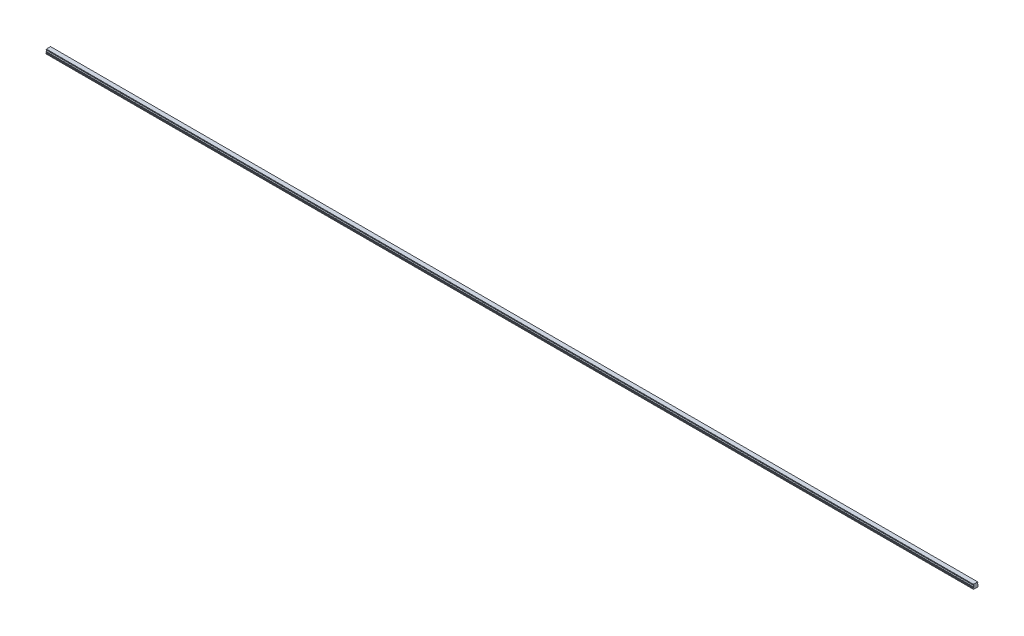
from build123d import *

# Parameters (mm, degrees)
BOSS_EXTRUDE1_DEPTH        = 2880
SKETCH3_R                  = 2.5
SKETCH3_R_2                = 2.1
CUT_EXTRUDE3_DEPTH         = 7
SKETCH3_2_R                = 2.1
CUT_EXTRUDE4_DEPTH         = 9.5
CHAMFER1_SIZE              = 0.4
LPATTERN2_COUNT            = 48
LPATTERN2_PITCH            = 60
CHAMFER1_OF_LPATTERN2_SIZE = 0.4


with BuildPart() as part:
    # Sketch1 → Boss-Extrude1 (new body)
    with BuildSketch(Plane(origin=(0, 0, 0), x_dir=(0, 0, -1), z_dir=(1, 0, 0))):
        with BuildLine():
            Line((6.59, 14), (-6.59, 14))
            Line((-6.59, 14), (-6.59, 13.15))
            Line((-6.59, 13.15), (-6.96, 12.356532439))
            Line((-6.96, 12.356532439), (-6.96, 11.435174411))
            ThreePointArc((-6.96, 11.435174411), (-5.25, 9.5), (-6.96, 7.564825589))
            Line((-6.96, 7.564825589), (-6.96, 6.643467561))
            Line((-6.96, 6.643467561), (-6.59, 5.85))
            Line((-6.59, 5.85), (-7.032116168, 4.2))
            Line((-7.032116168, 4.2), (-7.5, 3.929867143))
            Line((-7.5, 3.929867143), (-7.5, 1.4))
            Line((-7.5, 1.4), (-6.1, 0))
            Line((-6.1, 0), (-3.65, 0))
            Line((-3.65, 0), (-3.25, 0.4))
            Line((-3.25, 0.4), (3.25, 0.4))
            Line((3.25, 0.4), (3.65, 0))
            Line((3.65, 0), (6.1, 0))
            Line((6.1, 0), (7.5, 1.4))
            Line((7.5, 1.4), (7.5, 3.929867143))
            Line((7.5, 3.929867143), (7.032116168, 4.2))
            Line((7.032116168, 4.2), (6.59, 5.85))
            Line((6.59, 5.85), (6.96, 6.643467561))
            Line((6.96, 6.643467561), (6.96, 7.564825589))
            ThreePointArc((6.96, 7.564825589), (5.25, 9.5), (6.96, 11.435174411))
            Line((6.96, 11.435174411), (6.96, 12.356532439))
            Line((6.96, 12.356532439), (6.59, 13.15))
            Line((6.59, 13.15), (6.59, 14))
        make_face()
    extrude(amount=BOSS_EXTRUDE1_DEPTH)

    # Sketch3 → Cut-Extrude3 (cut)
    with BuildSketch(Plane.XZ):
        with Locations(Location((30, 0, 0), (0, 0, 270))):
            Circle(SKETCH3_R)
        with Locations(Location((30, 0, 0), (0, 0, 270))):
            Circle(SKETCH3_R_2, mode=Mode.SUBTRACT)
    cut_extrude3 = extrude(amount=-CUT_EXTRUDE3_DEPTH, mode=Mode.SUBTRACT)

    # Sketch3_2 → Cut-Extrude4 (cut)
    with BuildSketch(Plane.XZ):
        with Locations(Location((30, 0, 0), (0, 0, 270))):
            Circle(SKETCH3_2_R)
    cut_extrude4 = extrude(amount=-CUT_EXTRUDE4_DEPTH, mode=Mode.SUBTRACT)

    # Cut-Extrude5 cone 1 section (on through the dimple's axis) → Cut-Extrude5 (revolve, cut)
    with BuildSketch(Plane(origin=(30, 9.5, 0), x_dir=(0, 0, -1), z_dir=(1, 0, 0))):
        Polygon((0, 0), (2.1, 0), (0, 1.212435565), align=None)
    revolve(axis=Axis((30, 9.5, 0), (0, 1, 0)), mode=Mode.SUBTRACT)

    # Chamfer1
    chamfer1_edges = [part.edges().sort_by_distance(p)[0] for p in [
        (30, 0.4, 2.5),
    ]]
    chamfer(chamfer1_edges, length=CHAMFER1_SIZE)

    # LPattern2: Cut-Extrude3, Cut-Extrude4 ×48
    with Locations(*[(i * LPATTERN2_PITCH, 0, 0) for i in range(1, LPATTERN2_COUNT)]):
        add(cut_extrude3, mode=Mode.SUBTRACT)
        add(cut_extrude4, mode=Mode.SUBTRACT)

    # Chamfer1 of LPattern2
    chamfer1_of_lpattern2_edges = [part.edges().sort_by_distance(p)[0] for p in [
        (90, 0.4, 2.5),
        (150, 0.4, 2.5),
        (210, 0.4, 2.5),
        (270, 0.4, 2.5),
        (330, 0.4, 2.5),
        (390, 0.4, 2.5),
        (450, 0.4, 2.5),
        (510, 0.4, 2.5),
        (570, 0.4, 2.5),
        (630, 0.4, 2.5),
        (690, 0.4, 2.5),
        (750, 0.4, 2.5),
        (810, 0.4, 2.5),
        (870, 0.4, 2.5),
        (930, 0.4, 2.5),
        (990, 0.4, 2.5),
        (1050, 0.4, 2.5),
        (1110, 0.4, 2.5),
        (1170, 0.4, 2.5),
        (1230, 0.4, 2.5),
        (1290, 0.4, 2.5),
        (1350, 0.4, 2.5),
        (1410, 0.4, 2.5),
        (1470, 0.4, 2.5),
        (1530, 0.4, 2.5),
        (1590, 0.4, 2.5),
        (1650, 0.4, 2.5),
        (1710, 0.4, 2.5),
        (1770, 0.4, 2.5),
        (1830, 0.4, 2.5),
        (1890, 0.4, 2.5),
        (1950, 0.4, 2.5),
        (2010, 0.4, 2.5),
        (2070, 0.4, 2.5),
        (2130, 0.4, 2.5),
        (2190, 0.4, 2.5),
        (2250, 0.4, 2.5),
        (2310, 0.4, 2.5),
        (2370, 0.4, 2.5),
        (2430, 0.4, 2.5),
        (2490, 0.4, 2.5),
        (2550, 0.4, 2.5),
        (2610, 0.4, 2.5),
        (2670, 0.4, 2.5),
        (2730, 0.4, 2.5),
        (2790, 0.4, 2.5),
        (2850, 0.4, 2.5),
    ]]
    chamfer(chamfer1_of_lpattern2_edges, length=CHAMFER1_OF_LPATTERN2_SIZE)


solid = part.part
